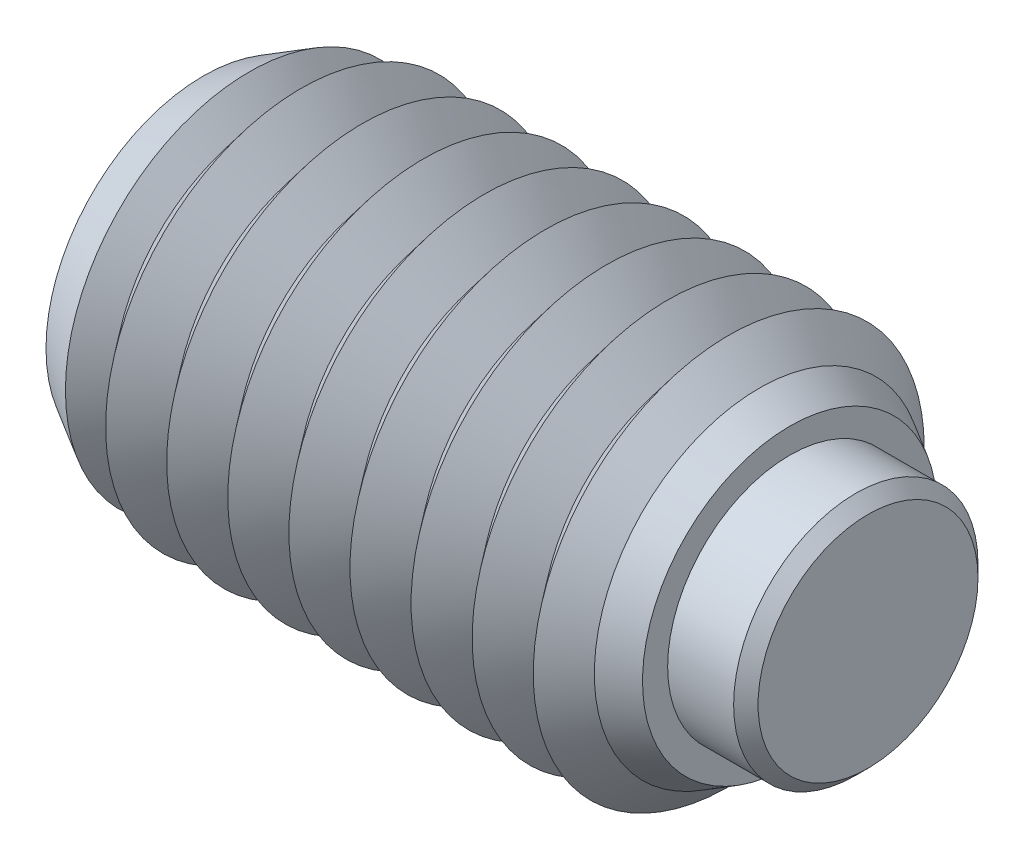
ISO-10303-21;
HEADER;
FILE_DESCRIPTION(('STEP AP214'),'2;1');
FILE_NAME('part.step','',(''),(''),'','','');
FILE_SCHEMA(('AUTOMOTIVE_DESIGN { 1 0 10303 214 1 1 1 1 }'));
ENDSEC;
DATA;
#1=APPLICATION_CONTEXT('core data for automotive mechanical design processes');
#2=APPLICATION_PROTOCOL_DEFINITION('international standard','automotive_design',2000,#1);
#3=PRODUCT_CONTEXT('',#1,'mechanical');
#4=PRODUCT('Part','Part','',(#3));
#5=PRODUCT_RELATED_PRODUCT_CATEGORY('part','',(#4));
#6=PRODUCT_DEFINITION_FORMATION('','',#4);
#7=PRODUCT_DEFINITION_CONTEXT('part definition',#1,'design');
#8=PRODUCT_DEFINITION('design','',#6,#7);
#9=PRODUCT_DEFINITION_SHAPE('','',#8);
#10=(LENGTH_UNIT() NAMED_UNIT(*) SI_UNIT(.MILLI.,.METRE.));
#11=(NAMED_UNIT(*) PLANE_ANGLE_UNIT() SI_UNIT($,.RADIAN.));
#12=(NAMED_UNIT(*) SI_UNIT($,.STERADIAN.) SOLID_ANGLE_UNIT());
#13=UNCERTAINTY_MEASURE_WITH_UNIT(LENGTH_MEASURE(1.E-05),#10,'distance_accuracy_value','');
#14=(GEOMETRIC_REPRESENTATION_CONTEXT(3) GLOBAL_UNCERTAINTY_ASSIGNED_CONTEXT((#13)) GLOBAL_UNIT_ASSIGNED_CONTEXT((#10,
#11,#12)) REPRESENTATION_CONTEXT('',''));
#15=CARTESIAN_POINT('',(0.,0.,0.));
#16=DIRECTION('',(0.,0.,1.));
#17=DIRECTION('',(1.,0.,0.));
#18=AXIS2_PLACEMENT_3D('',#15,#16,#17);
#19=CARTESIAN_POINT('',(2.225,0.,0.));
#20=DIRECTION('',(-1.,0.,0.));
#21=DIRECTION('',(0.,0.,1.));
#22=AXIS2_PLACEMENT_3D('',#19,#20,#21);
#23=CYLINDRICAL_SURFACE('',#22,2.5);
#24=CARTESIAN_POINT('',(1.975,0.,0.));
#25=DIRECTION('',(1.,0.,0.));
#26=DIRECTION('',(0.,0.,-1.));
#27=AXIS2_PLACEMENT_3D('',#24,#25,#26);
#28=CIRCLE('',#27,2.5);
#29=CARTESIAN_POINT('',(1.975,0.,-2.5));
#30=VERTEX_POINT('',#29);
#31=EDGE_CURVE('P0_E10',#30,#30,#28,.F.);
#32=ORIENTED_EDGE('',*,*,#31,.T.);
#33=EDGE_LOOP('',(#32));
#34=FACE_BOUND('',#33,.T.);
#35=CARTESIAN_POINT('',(-0.975,0.,0.));
#36=DIRECTION('',(1.,0.,0.));
#37=DIRECTION('',(0.,0.,-1.));
#38=AXIS2_PLACEMENT_3D('',#35,#36,#37);
#39=CIRCLE('',#38,2.5);
#40=CARTESIAN_POINT('',(-0.975,0.,-2.5));
#41=VERTEX_POINT('',#40);
#42=EDGE_CURVE('P0_E25',#41,#41,#39,.T.);
#43=ORIENTED_EDGE('',*,*,#42,.T.);
#44=EDGE_LOOP('',(#43));
#45=FACE_BOUND('',#44,.T.);
#46=ADVANCED_FACE('P0_F14',(#34,#45),#23,.T.);
#47=CARTESIAN_POINT('',(2.225,0.,0.));
#48=DIRECTION('',(1.,0.,0.));
#49=DIRECTION('',(0.,0.,-1.));
#50=AXIS2_PLACEMENT_3D('',#47,#48,#49);
#51=PLANE('',#50);
#52=CARTESIAN_POINT('',(2.225,0.,0.));
#53=DIRECTION('',(1.,0.,0.));
#54=DIRECTION('',(0.,0.,-1.));
#55=AXIS2_PLACEMENT_3D('',#52,#53,#54);
#56=CIRCLE('',#55,2.25);
#57=CARTESIAN_POINT('',(2.225,0.,-2.25));
#58=VERTEX_POINT('',#57);
#59=EDGE_CURVE('P0_E21',#58,#58,#56,.T.);
#60=ORIENTED_EDGE('',*,*,#59,.T.);
#61=EDGE_LOOP('',(#60));
#62=FACE_BOUND('',#61,.T.);
#63=ADVANCED_FACE('P0_F35',(#62),#51,.T.);
#64=CARTESIAN_POINT('',(-0.975,0.,0.));
#65=DIRECTION('',(1.,0.,0.));
#66=DIRECTION('',(0.,0.,-1.));
#67=AXIS2_PLACEMENT_3D('',#64,#65,#66);
#68=PLANE('',#67);
#69=ORIENTED_EDGE('',*,*,#42,.F.);
#70=EDGE_LOOP('',(#69));
#71=FACE_BOUND('',#70,.T.);
#72=ADVANCED_FACE('P0_F33',(#71),#68,.F.);
#73=CARTESIAN_POINT('',(2.225,0.,0.));
#74=DIRECTION('',(-1.,0.,0.));
#75=DIRECTION('',(0.,0.,1.));
#76=AXIS2_PLACEMENT_3D('',#73,#74,#75);
#77=CONICAL_SURFACE('',#76,2.25,0.785398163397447);
#78=ORIENTED_EDGE('',*,*,#31,.F.);
#79=EDGE_LOOP('',(#78));
#80=FACE_BOUND('',#79,.T.);
#81=ORIENTED_EDGE('',*,*,#59,.F.);
#82=EDGE_LOOP('',(#81));
#83=FACE_BOUND('',#82,.T.);
#84=ADVANCED_FACE('P0_F16',(#80,#83),#77,.T.);
#85=CLOSED_SHELL('',(#46,#63,#72,#84));
#86=MANIFOLD_SOLID_BREP('P0_B1',#85);
#87=CARTESIAN_POINT('',(-10.625,0.,0.));
#88=DIRECTION('',(-1.,0.,0.));
#89=DIRECTION('',(0.,0.,1.));
#90=AXIS2_PLACEMENT_3D('',#87,#88,#89);
#91=CONICAL_SURFACE('',#90,4.,0.895664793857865);
#92=CARTESIAN_POINT('',(-10.,0.,0.));
#93=DIRECTION('',(1.,0.,0.));
#94=DIRECTION('',(0.,0.,-1.));
#95=AXIS2_PLACEMENT_3D('',#92,#93,#94);
#96=CIRCLE('',#95,3.2193752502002);
#97=CARTESIAN_POINT('',(-10.,0.,-3.2193752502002));
#98=VERTEX_POINT('',#97);
#99=EDGE_CURVE('P1_E697',#98,#98,#96,.T.);
#100=ORIENTED_EDGE('',*,*,#99,.F.);
#101=EDGE_LOOP('',(#100));
#102=FACE_BOUND('',#101,.T.);
#103=CARTESIAN_POINT('',(-10.4346684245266,0.,0.));
#104=DIRECTION('',(1.,0.,0.));
#105=DIRECTION('',(0.,0.,-1.));
#106=AXIS2_PLACEMENT_3D('',#103,#104,#105);
#107=CIRCLE('',#106,3.76227593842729);
#108=CARTESIAN_POINT('',(-10.4346684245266,0.,-3.76227593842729));
#109=VERTEX_POINT('',#108);
#110=EDGE_CURVE('P1_E700',#109,#109,#107,.F.);
#111=ORIENTED_EDGE('',*,*,#110,.F.);
#112=EDGE_LOOP('',(#111));
#113=FACE_BOUND('',#112,.T.);
#114=ADVANCED_FACE('P1_F15',(#102,#113),#91,.T.);
#115=CARTESIAN_POINT('',(-1.25,0.,0.));
#116=DIRECTION('',(1.,0.,0.));
#117=DIRECTION('',(0.,0.,-1.));
#118=AXIS2_PLACEMENT_3D('',#115,#116,#117);
#119=CONICAL_SURFACE('',#118,3.2193752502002,0.895664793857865);
#120=CARTESIAN_POINT('',(-0.625000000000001,0.,0.));
#121=DIRECTION('',(1.,0.,0.));
#122=DIRECTION('',(0.,0.,-1.));
#123=AXIS2_PLACEMENT_3D('',#120,#121,#122);
#124=CIRCLE('',#123,4.);
#125=CARTESIAN_POINT('',(-0.625000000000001,0.,-4.));
#126=VERTEX_POINT('',#125);
#127=EDGE_CURVE('P1_E651',#126,#126,#124,.T.);
#128=ORIENTED_EDGE('',*,*,#127,.F.);
#129=EDGE_LOOP('',(#128));
#130=FACE_BOUND('',#129,.T.);
#131=CARTESIAN_POINT('',(-1.25,0.,0.));
#132=DIRECTION('',(1.,0.,0.));
#133=DIRECTION('',(0.,0.,-1.));
#134=AXIS2_PLACEMENT_3D('',#131,#132,#133);
#135=CIRCLE('',#134,3.2193752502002);
#136=CARTESIAN_POINT('',(-1.25,0.,-3.2193752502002));
#137=VERTEX_POINT('',#136);
#138=EDGE_CURVE('P1_E652',#137,#137,#135,.T.);
#139=ORIENTED_EDGE('',*,*,#138,.T.);
#140=EDGE_LOOP('',(#139));
#141=FACE_BOUND('',#140,.T.);
#142=ADVANCED_FACE('P1_F222',(#130,#141),#119,.T.);
#143=CARTESIAN_POINT('',(-1.875,0.,0.));
#144=DIRECTION('',(-1.,0.,0.));
#145=DIRECTION('',(0.,0.,1.));
#146=AXIS2_PLACEMENT_3D('',#143,#144,#145);
#147=CONICAL_SURFACE('',#146,4.,0.895664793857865);
#148=ORIENTED_EDGE('',*,*,#138,.F.);
#149=EDGE_LOOP('',(#148));
#150=FACE_BOUND('',#149,.T.);
#151=CARTESIAN_POINT('',(-1.875,0.,0.));
#152=DIRECTION('',(1.,0.,0.));
#153=DIRECTION('',(0.,0.,-1.));
#154=AXIS2_PLACEMENT_3D('',#151,#152,#153);
#155=CIRCLE('',#154,4.);
#156=CARTESIAN_POINT('',(-1.875,0.,-4.));
#157=VERTEX_POINT('',#156);
#158=EDGE_CURVE('P1_E656',#157,#157,#155,.T.);
#159=ORIENTED_EDGE('',*,*,#158,.T.);
#160=EDGE_LOOP('',(#159));
#161=FACE_BOUND('',#160,.T.);
#162=ADVANCED_FACE('P1_F227',(#150,#161),#147,.T.);
#163=CARTESIAN_POINT('',(-0.975,0.,0.));
#164=DIRECTION('',(1.,0.,0.));
#165=DIRECTION('',(0.,1.,0.));
#166=AXIS2_PLACEMENT_3D('',#163,#164,#165);
#167=PLANE('',#166);
#168=CARTESIAN_POINT('',(-0.975,0.,0.));
#169=DIRECTION('',(1.,0.,0.));
#170=DIRECTION('',(0.,1.,0.));
#171=AXIS2_PLACEMENT_3D('',#168,#169,#170);
#172=CIRCLE('',#171,2.5);
#173=CARTESIAN_POINT('',(-0.975,2.5,0.));
#174=VERTEX_POINT('',#173);
#175=EDGE_CURVE('P1_E358',#174,#174,#172,.T.);
#176=ORIENTED_EDGE('',*,*,#175,.T.);
#177=EDGE_LOOP('',(#176));
#178=FACE_BOUND('',#177,.T.);
#179=ADVANCED_FACE('P1_F285',(#178),#167,.T.);
#180=CARTESIAN_POINT('',(-0.975,0.,0.));
#181=DIRECTION('',(1.,0.,0.));
#182=DIRECTION('',(0.,1.,0.));
#183=AXIS2_PLACEMENT_3D('',#180,#181,#182);
#184=CYLINDRICAL_SURFACE('',#183,2.5);
#185=ORIENTED_EDGE('',*,*,#175,.F.);
#186=EDGE_LOOP('',(#185));
#187=FACE_BOUND('',#186,.T.);
#188=CARTESIAN_POINT('',(0.625,0.,0.));
#189=DIRECTION('',(1.,0.,0.));
#190=DIRECTION('',(0.,1.,0.));
#191=AXIS2_PLACEMENT_3D('',#188,#189,#190);
#192=CIRCLE('',#191,2.5);
#193=CARTESIAN_POINT('',(0.625,2.5,0.));
#194=VERTEX_POINT('',#193);
#195=EDGE_CURVE('P1_E361',#194,#194,#192,.T.);
#196=ORIENTED_EDGE('',*,*,#195,.T.);
#197=EDGE_LOOP('',(#196));
#198=FACE_BOUND('',#197,.T.);
#199=ADVANCED_FACE('P1_F209',(#187,#198),#184,.F.);
#200=CARTESIAN_POINT('',(0.625,3.01415608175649,0.));
#201=DIRECTION('',(1.,0.,0.));
#202=DIRECTION('',(0.,1.,0.));
#203=AXIS2_PLACEMENT_3D('',#200,#201,#202);
#204=PLANE('',#203);
#205=ORIENTED_EDGE('',*,*,#195,.F.);
#206=EDGE_LOOP('',(#205));
#207=FACE_BOUND('',#206,.T.);
#208=CARTESIAN_POINT('',(0.625,0.,0.));
#209=DIRECTION('',(1.,0.,0.));
#210=DIRECTION('',(0.,1.,0.));
#211=AXIS2_PLACEMENT_3D('',#208,#209,#210);
#212=CIRCLE('',#211,3.01415608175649);
#213=CARTESIAN_POINT('',(0.625,3.01415608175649,0.));
#214=VERTEX_POINT('',#213);
#215=EDGE_CURVE('P1_E121',#214,#214,#212,.T.);
#216=ORIENTED_EDGE('',*,*,#215,.T.);
#217=EDGE_LOOP('',(#216));
#218=FACE_BOUND('',#217,.T.);
#219=ADVANCED_FACE('P1_F206',(#207,#218),#204,.T.);
#220=CARTESIAN_POINT('',(0.625,0.,0.));
#221=DIRECTION('',(-1.,0.,0.));
#222=DIRECTION('',(0.,-1.,0.));
#223=AXIS2_PLACEMENT_3D('',#220,#221,#222);
#224=CONICAL_SURFACE('',#223,3.01415608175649,0.523598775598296);
#225=CARTESIAN_POINT('',(0.,0.,0.));
#226=DIRECTION('',(1.,0.,0.));
#227=DIRECTION('',(0.,0.,-1.));
#228=AXIS2_PLACEMENT_3D('',#225,#226,#227);
#229=CIRCLE('',#228,3.375);
#230=CARTESIAN_POINT('',(0.,0.,-3.375));
#231=VERTEX_POINT('',#230);
#232=EDGE_CURVE('P1_E349',#231,#231,#229,.T.);
#233=ORIENTED_EDGE('',*,*,#232,.T.);
#234=EDGE_LOOP('',(#233));
#235=FACE_BOUND('',#234,.T.);
#236=ORIENTED_EDGE('',*,*,#215,.F.);
#237=EDGE_LOOP('',(#236));
#238=FACE_BOUND('',#237,.T.);
#239=ADVANCED_FACE('P1_F203',(#235,#238),#224,.T.);
#240=CARTESIAN_POINT('',(0.,0.,0.));
#241=DIRECTION('',(-1.,0.,0.));
#242=DIRECTION('',(0.,0.,1.));
#243=AXIS2_PLACEMENT_3D('',#240,#241,#242);
#244=CONICAL_SURFACE('',#243,3.375,0.785398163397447);
#245=ORIENTED_EDGE('',*,*,#127,.T.);
#246=EDGE_LOOP('',(#245));
#247=FACE_BOUND('',#246,.T.);
#248=ORIENTED_EDGE('',*,*,#232,.F.);
#249=EDGE_LOOP('',(#248));
#250=FACE_BOUND('',#249,.T.);
#251=ADVANCED_FACE('P1_F17',(#247,#250),#244,.T.);
#252=CARTESIAN_POINT('',(-2.5,0.,0.));
#253=DIRECTION('',(1.,0.,0.));
#254=DIRECTION('',(0.,0.,-1.));
#255=AXIS2_PLACEMENT_3D('',#252,#253,#254);
#256=CONICAL_SURFACE('',#255,3.2193752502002,0.895664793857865);
#257=ORIENTED_EDGE('',*,*,#158,.F.);
#258=EDGE_LOOP('',(#257));
#259=FACE_BOUND('',#258,.T.);
#260=CARTESIAN_POINT('',(-2.5,0.,0.));
#261=DIRECTION('',(1.,0.,0.));
#262=DIRECTION('',(0.,0.,-1.));
#263=AXIS2_PLACEMENT_3D('',#260,#261,#262);
#264=CIRCLE('',#263,3.2193752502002);
#265=CARTESIAN_POINT('',(-2.5,0.,-3.2193752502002));
#266=VERTEX_POINT('',#265);
#267=EDGE_CURVE('P1_E661',#266,#266,#264,.T.);
#268=ORIENTED_EDGE('',*,*,#267,.T.);
#269=EDGE_LOOP('',(#268));
#270=FACE_BOUND('',#269,.T.);
#271=ADVANCED_FACE('P1_F279',(#259,#270),#256,.T.);
#272=CARTESIAN_POINT('',(-3.125,0.,0.));
#273=DIRECTION('',(-1.,0.,0.));
#274=DIRECTION('',(0.,0.,1.));
#275=AXIS2_PLACEMENT_3D('',#272,#273,#274);
#276=CONICAL_SURFACE('',#275,4.,0.895664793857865);
#277=ORIENTED_EDGE('',*,*,#267,.F.);
#278=EDGE_LOOP('',(#277));
#279=FACE_BOUND('',#278,.T.);
#280=CARTESIAN_POINT('',(-3.125,0.,0.));
#281=DIRECTION('',(1.,0.,0.));
#282=DIRECTION('',(0.,0.,-1.));
#283=AXIS2_PLACEMENT_3D('',#280,#281,#282);
#284=CIRCLE('',#283,4.);
#285=CARTESIAN_POINT('',(-3.125,0.,-4.));
#286=VERTEX_POINT('',#285);
#287=EDGE_CURVE('P1_E664',#286,#286,#284,.T.);
#288=ORIENTED_EDGE('',*,*,#287,.T.);
#289=EDGE_LOOP('',(#288));
#290=FACE_BOUND('',#289,.T.);
#291=ADVANCED_FACE('P1_F275',(#279,#290),#276,.T.);
#292=CARTESIAN_POINT('',(-3.75,0.,0.));
#293=DIRECTION('',(1.,0.,0.));
#294=DIRECTION('',(0.,0.,-1.));
#295=AXIS2_PLACEMENT_3D('',#292,#293,#294);
#296=CONICAL_SURFACE('',#295,3.2193752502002,0.895664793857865);
#297=ORIENTED_EDGE('',*,*,#287,.F.);
#298=EDGE_LOOP('',(#297));
#299=FACE_BOUND('',#298,.T.);
#300=CARTESIAN_POINT('',(-3.75,0.,0.));
#301=DIRECTION('',(1.,0.,0.));
#302=DIRECTION('',(0.,0.,-1.));
#303=AXIS2_PLACEMENT_3D('',#300,#301,#302);
#304=CIRCLE('',#303,3.2193752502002);
#305=CARTESIAN_POINT('',(-3.75,0.,-3.2193752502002));
#306=VERTEX_POINT('',#305);
#307=EDGE_CURVE('P1_E667',#306,#306,#304,.T.);
#308=ORIENTED_EDGE('',*,*,#307,.T.);
#309=EDGE_LOOP('',(#308));
#310=FACE_BOUND('',#309,.T.);
#311=ADVANCED_FACE('P1_F271',(#299,#310),#296,.T.);
#312=CARTESIAN_POINT('',(-4.375,0.,0.));
#313=DIRECTION('',(-1.,0.,0.));
#314=DIRECTION('',(0.,0.,1.));
#315=AXIS2_PLACEMENT_3D('',#312,#313,#314);
#316=CONICAL_SURFACE('',#315,4.,0.895664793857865);
#317=ORIENTED_EDGE('',*,*,#307,.F.);
#318=EDGE_LOOP('',(#317));
#319=FACE_BOUND('',#318,.T.);
#320=CARTESIAN_POINT('',(-4.375,0.,0.));
#321=DIRECTION('',(1.,0.,0.));
#322=DIRECTION('',(0.,0.,-1.));
#323=AXIS2_PLACEMENT_3D('',#320,#321,#322);
#324=CIRCLE('',#323,4.);
#325=CARTESIAN_POINT('',(-4.375,0.,-4.));
#326=VERTEX_POINT('',#325);
#327=EDGE_CURVE('P1_E670',#326,#326,#324,.T.);
#328=ORIENTED_EDGE('',*,*,#327,.T.);
#329=EDGE_LOOP('',(#328));
#330=FACE_BOUND('',#329,.T.);
#331=ADVANCED_FACE('P1_F267',(#319,#330),#316,.T.);
#332=CARTESIAN_POINT('',(-5.,0.,0.));
#333=DIRECTION('',(1.,0.,0.));
#334=DIRECTION('',(0.,0.,-1.));
#335=AXIS2_PLACEMENT_3D('',#332,#333,#334);
#336=CONICAL_SURFACE('',#335,3.2193752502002,0.895664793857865);
#337=ORIENTED_EDGE('',*,*,#327,.F.);
#338=EDGE_LOOP('',(#337));
#339=FACE_BOUND('',#338,.T.);
#340=CARTESIAN_POINT('',(-5.,0.,0.));
#341=DIRECTION('',(1.,0.,0.));
#342=DIRECTION('',(0.,0.,-1.));
#343=AXIS2_PLACEMENT_3D('',#340,#341,#342);
#344=CIRCLE('',#343,3.2193752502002);
#345=CARTESIAN_POINT('',(-5.,0.,-3.2193752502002));
#346=VERTEX_POINT('',#345);
#347=EDGE_CURVE('P1_E673',#346,#346,#344,.T.);
#348=ORIENTED_EDGE('',*,*,#347,.T.);
#349=EDGE_LOOP('',(#348));
#350=FACE_BOUND('',#349,.T.);
#351=ADVANCED_FACE('P1_F263',(#339,#350),#336,.T.);
#352=CARTESIAN_POINT('',(-5.625,0.,0.));
#353=DIRECTION('',(-1.,0.,0.));
#354=DIRECTION('',(0.,0.,1.));
#355=AXIS2_PLACEMENT_3D('',#352,#353,#354);
#356=CONICAL_SURFACE('',#355,4.,0.895664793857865);
#357=ORIENTED_EDGE('',*,*,#347,.F.);
#358=EDGE_LOOP('',(#357));
#359=FACE_BOUND('',#358,.T.);
#360=CARTESIAN_POINT('',(-5.625,0.,0.));
#361=DIRECTION('',(1.,0.,0.));
#362=DIRECTION('',(0.,0.,-1.));
#363=AXIS2_PLACEMENT_3D('',#360,#361,#362);
#364=CIRCLE('',#363,4.);
#365=CARTESIAN_POINT('',(-5.625,0.,-4.));
#366=VERTEX_POINT('',#365);
#367=EDGE_CURVE('P1_E676',#366,#366,#364,.T.);
#368=ORIENTED_EDGE('',*,*,#367,.T.);
#369=EDGE_LOOP('',(#368));
#370=FACE_BOUND('',#369,.T.);
#371=ADVANCED_FACE('P1_F259',(#359,#370),#356,.T.);
#372=CARTESIAN_POINT('',(-6.25,0.,0.));
#373=DIRECTION('',(1.,0.,0.));
#374=DIRECTION('',(0.,0.,-1.));
#375=AXIS2_PLACEMENT_3D('',#372,#373,#374);
#376=CONICAL_SURFACE('',#375,3.2193752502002,0.895664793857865);
#377=ORIENTED_EDGE('',*,*,#367,.F.);
#378=EDGE_LOOP('',(#377));
#379=FACE_BOUND('',#378,.T.);
#380=CARTESIAN_POINT('',(-6.25,0.,0.));
#381=DIRECTION('',(1.,0.,0.));
#382=DIRECTION('',(0.,0.,-1.));
#383=AXIS2_PLACEMENT_3D('',#380,#381,#382);
#384=CIRCLE('',#383,3.2193752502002);
#385=CARTESIAN_POINT('',(-6.25,0.,-3.2193752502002));
#386=VERTEX_POINT('',#385);
#387=EDGE_CURVE('P1_E679',#386,#386,#384,.T.);
#388=ORIENTED_EDGE('',*,*,#387,.T.);
#389=EDGE_LOOP('',(#388));
#390=FACE_BOUND('',#389,.T.);
#391=ADVANCED_FACE('P1_F255',(#379,#390),#376,.T.);
#392=CARTESIAN_POINT('',(-6.875,0.,0.));
#393=DIRECTION('',(-1.,0.,0.));
#394=DIRECTION('',(0.,0.,1.));
#395=AXIS2_PLACEMENT_3D('',#392,#393,#394);
#396=CONICAL_SURFACE('',#395,4.,0.895664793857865);
#397=ORIENTED_EDGE('',*,*,#387,.F.);
#398=EDGE_LOOP('',(#397));
#399=FACE_BOUND('',#398,.T.);
#400=CARTESIAN_POINT('',(-6.875,0.,0.));
#401=DIRECTION('',(1.,0.,0.));
#402=DIRECTION('',(0.,0.,-1.));
#403=AXIS2_PLACEMENT_3D('',#400,#401,#402);
#404=CIRCLE('',#403,4.);
#405=CARTESIAN_POINT('',(-6.875,0.,-4.));
#406=VERTEX_POINT('',#405);
#407=EDGE_CURVE('P1_E682',#406,#406,#404,.T.);
#408=ORIENTED_EDGE('',*,*,#407,.T.);
#409=EDGE_LOOP('',(#408));
#410=FACE_BOUND('',#409,.T.);
#411=ADVANCED_FACE('P1_F251',(#399,#410),#396,.T.);
#412=CARTESIAN_POINT('',(-7.5,0.,0.));
#413=DIRECTION('',(1.,0.,0.));
#414=DIRECTION('',(0.,0.,-1.));
#415=AXIS2_PLACEMENT_3D('',#412,#413,#414);
#416=CONICAL_SURFACE('',#415,3.2193752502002,0.895664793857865);
#417=ORIENTED_EDGE('',*,*,#407,.F.);
#418=EDGE_LOOP('',(#417));
#419=FACE_BOUND('',#418,.T.);
#420=CARTESIAN_POINT('',(-7.5,0.,0.));
#421=DIRECTION('',(1.,0.,0.));
#422=DIRECTION('',(0.,0.,-1.));
#423=AXIS2_PLACEMENT_3D('',#420,#421,#422);
#424=CIRCLE('',#423,3.2193752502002);
#425=CARTESIAN_POINT('',(-7.5,0.,-3.2193752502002));
#426=VERTEX_POINT('',#425);
#427=EDGE_CURVE('P1_E685',#426,#426,#424,.T.);
#428=ORIENTED_EDGE('',*,*,#427,.T.);
#429=EDGE_LOOP('',(#428));
#430=FACE_BOUND('',#429,.T.);
#431=ADVANCED_FACE('P1_F247',(#419,#430),#416,.T.);
#432=CARTESIAN_POINT('',(-8.125,0.,0.));
#433=DIRECTION('',(-1.,0.,0.));
#434=DIRECTION('',(0.,0.,1.));
#435=AXIS2_PLACEMENT_3D('',#432,#433,#434);
#436=CONICAL_SURFACE('',#435,4.,0.895664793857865);
#437=ORIENTED_EDGE('',*,*,#427,.F.);
#438=EDGE_LOOP('',(#437));
#439=FACE_BOUND('',#438,.T.);
#440=CARTESIAN_POINT('',(-8.125,0.,0.));
#441=DIRECTION('',(1.,0.,0.));
#442=DIRECTION('',(0.,0.,-1.));
#443=AXIS2_PLACEMENT_3D('',#440,#441,#442);
#444=CIRCLE('',#443,4.);
#445=CARTESIAN_POINT('',(-8.125,0.,-4.));
#446=VERTEX_POINT('',#445);
#447=EDGE_CURVE('P1_E688',#446,#446,#444,.T.);
#448=ORIENTED_EDGE('',*,*,#447,.T.);
#449=EDGE_LOOP('',(#448));
#450=FACE_BOUND('',#449,.T.);
#451=ADVANCED_FACE('P1_F243',(#439,#450),#436,.T.);
#452=CARTESIAN_POINT('',(-8.75,0.,0.));
#453=DIRECTION('',(1.,0.,0.));
#454=DIRECTION('',(0.,0.,-1.));
#455=AXIS2_PLACEMENT_3D('',#452,#453,#454);
#456=CONICAL_SURFACE('',#455,3.2193752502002,0.895664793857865);
#457=ORIENTED_EDGE('',*,*,#447,.F.);
#458=EDGE_LOOP('',(#457));
#459=FACE_BOUND('',#458,.T.);
#460=CARTESIAN_POINT('',(-8.75,0.,0.));
#461=DIRECTION('',(1.,0.,0.));
#462=DIRECTION('',(0.,0.,-1.));
#463=AXIS2_PLACEMENT_3D('',#460,#461,#462);
#464=CIRCLE('',#463,3.2193752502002);
#465=CARTESIAN_POINT('',(-8.75,0.,-3.2193752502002));
#466=VERTEX_POINT('',#465);
#467=EDGE_CURVE('P1_E691',#466,#466,#464,.T.);
#468=ORIENTED_EDGE('',*,*,#467,.T.);
#469=EDGE_LOOP('',(#468));
#470=FACE_BOUND('',#469,.T.);
#471=ADVANCED_FACE('P1_F239',(#459,#470),#456,.T.);
#472=CARTESIAN_POINT('',(-9.375,0.,0.));
#473=DIRECTION('',(-1.,0.,0.));
#474=DIRECTION('',(0.,0.,1.));
#475=AXIS2_PLACEMENT_3D('',#472,#473,#474);
#476=CONICAL_SURFACE('',#475,4.,0.895664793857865);
#477=ORIENTED_EDGE('',*,*,#467,.F.);
#478=EDGE_LOOP('',(#477));
#479=FACE_BOUND('',#478,.T.);
#480=CARTESIAN_POINT('',(-9.375,0.,0.));
#481=DIRECTION('',(1.,0.,0.));
#482=DIRECTION('',(0.,0.,-1.));
#483=AXIS2_PLACEMENT_3D('',#480,#481,#482);
#484=CIRCLE('',#483,4.);
#485=CARTESIAN_POINT('',(-9.375,0.,-4.));
#486=VERTEX_POINT('',#485);
#487=EDGE_CURVE('P1_E694',#486,#486,#484,.T.);
#488=ORIENTED_EDGE('',*,*,#487,.T.);
#489=EDGE_LOOP('',(#488));
#490=FACE_BOUND('',#489,.T.);
#491=ADVANCED_FACE('P1_F235',(#479,#490),#476,.T.);
#492=CARTESIAN_POINT('',(-10.,0.,0.));
#493=DIRECTION('',(1.,0.,0.));
#494=DIRECTION('',(0.,0.,-1.));
#495=AXIS2_PLACEMENT_3D('',#492,#493,#494);
#496=CONICAL_SURFACE('',#495,3.2193752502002,0.895664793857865);
#497=ORIENTED_EDGE('',*,*,#487,.F.);
#498=EDGE_LOOP('',(#497));
#499=FACE_BOUND('',#498,.T.);
#500=ORIENTED_EDGE('',*,*,#99,.T.);
#501=EDGE_LOOP('',(#500));
#502=FACE_BOUND('',#501,.T.);
#503=ADVANCED_FACE('P1_F219',(#499,#502),#496,.T.);
#504=CARTESIAN_POINT('',(-11.375,0.,0.));
#505=DIRECTION('',(1.,0.,0.));
#506=DIRECTION('',(0.,0.,1.));
#507=AXIS2_PLACEMENT_3D('',#504,#505,#506);
#508=CONICAL_SURFACE('',#507,3.2193752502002,0.5235987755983);
#509=CARTESIAN_POINT('',(-11.375,0.,0.));
#510=DIRECTION('',(-1.,0.,0.));
#511=DIRECTION('',(0.,0.,1.));
#512=AXIS2_PLACEMENT_3D('',#509,#510,#511);
#513=CIRCLE('',#512,3.2193752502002);
#514=CARTESIAN_POINT('',(-11.375,0.,3.2193752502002));
#515=VERTEX_POINT('',#514);
#516=EDGE_CURVE('P1_E702',#515,#515,#513,.T.);
#517=ORIENTED_EDGE('',*,*,#516,.F.);
#518=EDGE_LOOP('',(#517));
#519=FACE_BOUND('',#518,.T.);
#520=ORIENTED_EDGE('',*,*,#110,.T.);
#521=EDGE_LOOP('',(#520));
#522=FACE_BOUND('',#521,.T.);
#523=ADVANCED_FACE('P1_F159',(#519,#522),#508,.T.);
#524=CARTESIAN_POINT('',(-11.375,0.,0.));
#525=DIRECTION('',(1.,0.,0.));
#526=DIRECTION('',(0.,0.,-1.));
#527=AXIS2_PLACEMENT_3D('',#524,#525,#526);
#528=PLANE('',#527);
#529=CARTESIAN_POINT('',(-11.375,0.,0.));
#530=DIRECTION('',(1.,0.,0.));
#531=DIRECTION('',(0.,0.,-1.));
#532=AXIS2_PLACEMENT_3D('',#529,#530,#531);
#533=CIRCLE('',#532,2.3094010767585);
#534=CARTESIAN_POINT('',(-11.375,-2.,-1.15470053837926));
#535=VERTEX_POINT('',#534);
#536=CARTESIAN_POINT('',(-11.375,0.,-2.3094010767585));
#537=VERTEX_POINT('',#536);
#538=EDGE_CURVE('P1_E19',#535,#537,#533,.T.);
#539=ORIENTED_EDGE('',*,*,#538,.T.);
#540=CARTESIAN_POINT('',(-11.375,2.,-1.15470053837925));
#541=VERTEX_POINT('',#540);
#542=EDGE_CURVE('P1_E10',#537,#541,#533,.T.);
#543=ORIENTED_EDGE('',*,*,#542,.T.);
#544=CARTESIAN_POINT('',(-11.375,2.,1.15470053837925));
#545=VERTEX_POINT('',#544);
#546=EDGE_CURVE('P1_E24',#541,#545,#533,.T.);
#547=ORIENTED_EDGE('',*,*,#546,.T.);
#548=CARTESIAN_POINT('',(-11.375,0.,0.));
#549=DIRECTION('',(-1.,0.,0.));
#550=DIRECTION('',(0.,0.,1.));
#551=AXIS2_PLACEMENT_3D('',#548,#549,#550);
#552=CIRCLE('',#551,2.3094010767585);
#553=CARTESIAN_POINT('',(-11.375,0.,2.3094010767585));
#554=VERTEX_POINT('',#553);
#555=EDGE_CURVE('P1_E92',#554,#545,#552,.T.);
#556=ORIENTED_EDGE('',*,*,#555,.F.);
#557=CARTESIAN_POINT('',(-11.375,-2.,1.15470053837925));
#558=VERTEX_POINT('',#557);
#559=EDGE_CURVE('P1_E101',#554,#558,#533,.T.);
#560=ORIENTED_EDGE('',*,*,#559,.T.);
#561=EDGE_CURVE('P1_E107',#558,#535,#533,.T.);
#562=ORIENTED_EDGE('',*,*,#561,.T.);
#563=EDGE_LOOP('',(#539,#543,#547,#556,#560,#562));
#564=FACE_BOUND('',#563,.T.);
#565=ORIENTED_EDGE('',*,*,#516,.T.);
#566=EDGE_LOOP('',(#565));
#567=FACE_BOUND('',#566,.T.);
#568=ADVANCED_FACE('P1_F108',(#564,#567),#528,.F.);
#569=CARTESIAN_POINT('',(-11.375,0.,0.));
#570=DIRECTION('',(-1.,0.,0.));
#571=DIRECTION('',(0.,0.,1.));
#572=AXIS2_PLACEMENT_3D('',#569,#570,#571);
#573=CONICAL_SURFACE('',#572,2.3094010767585,1.0471975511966);
#574=ORIENTED_EDGE('',*,*,#538,.F.);
#575=CARTESIAN_POINT('',(-11.3750666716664,0.000199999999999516,-2.30951654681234));
#576=CARTESIAN_POINT('',(-11.3457567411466,-0.0876912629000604,-2.25877250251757));
#577=CARTESIAN_POINT('',(-11.3191000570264,-0.176341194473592,-2.20759044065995));
#578=CARTESIAN_POINT('',(-11.2725696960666,-0.355176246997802,-2.10433997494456));
#579=CARTESIAN_POINT('',(-11.2527124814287,-0.445364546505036,-2.0522697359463));
#580=CARTESIAN_POINT('',(-11.2218006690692,-0.624623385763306,-1.94877459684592));
#581=CARTESIAN_POINT('',(-11.2105403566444,-0.713666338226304,-1.89736562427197));
#582=CARTESIAN_POINT('',(-11.1970958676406,-0.892171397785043,-1.79430568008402));
#583=CARTESIAN_POINT('',(-11.1949005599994,-0.981632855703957,-1.74265508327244));
#584=CARTESIAN_POINT('',(-11.1994581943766,-1.1488083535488,-1.64613626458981));
#585=CARTESIAN_POINT('',(-11.2050920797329,-1.22654737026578,-1.60125362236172));
#586=CARTESIAN_POINT('',(-11.2229511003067,-1.38151891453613,-1.51178075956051));
#587=CARTESIAN_POINT('',(-11.2351823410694,-1.4587509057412,-1.46719084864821));
#588=CARTESIAN_POINT('',(-11.2657606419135,-1.6140421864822,-1.37753338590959));
#589=CARTESIAN_POINT('',(-11.2842373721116,-1.69208181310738,-1.33247718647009));
#590=CARTESIAN_POINT('',(-11.3261727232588,-1.84699686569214,-1.24303693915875));
#591=CARTESIAN_POINT('',(-11.3496214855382,-1.92387427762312,-1.1986517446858));
#592=CARTESIAN_POINT('',(-11.3750666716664,-2.0002,-1.15458506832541));
#593=B_SPLINE_CURVE_WITH_KNOTS('',3,(#575,#576,#577,#578,#579,#580,#581,#582,#583,#584,#585,
#586,#587,#588,#589,#590,#591,#592),.UNSPECIFIED.,.F.,.F.,(4,2,2,2,2,2,2,2,4),(0.,
0.317031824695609,0.634825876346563,0.944753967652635,1.25430138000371,1.52387047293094,
1.79368946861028,2.06949491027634,2.34475850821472),.UNSPECIFIED.);
#594=EDGE_CURVE('P1_E130',#537,#535,#593,.T.);
#595=ORIENTED_EDGE('',*,*,#594,.F.);
#596=EDGE_LOOP('',(#574,#595));
#597=FACE_BOUND('',#596,.T.);
#598=ADVANCED_FACE('P1_F158',(#597),#573,.F.);
#599=ORIENTED_EDGE('',*,*,#561,.F.);
#600=CARTESIAN_POINT('',(-12.1186705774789,-2.,-2.99029024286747));
#601=CARTESIAN_POINT('',(-12.0772350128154,-2.,-2.90392335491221));
#602=CARTESIAN_POINT('',(-12.0362298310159,-2.,-2.81734606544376));
#603=CARTESIAN_POINT('',(-11.9553243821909,-2.,-2.64365854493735));
#604=CARTESIAN_POINT('',(-11.9154243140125,-2.,-2.55654822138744));
#605=CARTESIAN_POINT('',(-11.8367503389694,-2.,-2.38118302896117));
#606=CARTESIAN_POINT('',(-11.7979847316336,-2.,-2.29292442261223));
#607=CARTESIAN_POINT('',(-11.7221918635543,-2.,-2.11566660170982));
#608=CARTESIAN_POINT('',(-11.6851645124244,-2.,-2.02666742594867));
#609=CARTESIAN_POINT('',(-11.6123681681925,-2.,-1.84544249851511));
#610=CARTESIAN_POINT('',(-11.576657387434,-2.,-1.75319322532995));
#611=CARTESIAN_POINT('',(-11.5082048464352,-2.,-1.56757885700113));
#612=CARTESIAN_POINT('',(-11.4754634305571,-2.,-1.4742136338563));
#613=CARTESIAN_POINT('',(-11.4138859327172,-2.,-1.28643446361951));
#614=CARTESIAN_POINT('',(-11.3850408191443,-2.,-1.19202351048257));
#615=CARTESIAN_POINT('',(-11.3322423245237,-2.,-1.00184859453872));
#616=CARTESIAN_POINT('',(-11.3082877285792,-2.,-0.906084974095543));
#617=CARTESIAN_POINT('',(-11.2665474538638,-2.,-0.713403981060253));
#618=CARTESIAN_POINT('',(-11.2487491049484,-2.,-0.616489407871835));
#619=CARTESIAN_POINT('',(-11.2204859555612,-2.,-0.421576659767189));
#620=CARTESIAN_POINT('',(-11.2100206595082,-2.,-0.323578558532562));
#621=CARTESIAN_POINT('',(-11.1973976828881,-2.,-0.128212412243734));
#622=CARTESIAN_POINT('',(-11.1951419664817,-2.,-0.0308508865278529));
#623=CARTESIAN_POINT('',(-11.1988660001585,-2.,0.163710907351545));
#624=CARTESIAN_POINT('',(-11.2048462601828,-2.,0.260911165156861));
#625=CARTESIAN_POINT('',(-11.2292367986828,-2.,0.500738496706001));
#626=CARTESIAN_POINT('',(-11.2522179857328,-2.,0.642900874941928));
#627=CARTESIAN_POINT('',(-11.3114797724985,-2.,0.924461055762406));
#628=CARTESIAN_POINT('',(-11.3477764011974,-2.,1.06385531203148));
#629=CARTESIAN_POINT('',(-11.4097799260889,-2.,1.27233476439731));
#630=CARTESIAN_POINT('',(-11.4319967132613,-2.,1.34249760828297));
#631=CARTESIAN_POINT('',(-11.4784854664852,-2.,1.48209294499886));
#632=CARTESIAN_POINT('',(-11.5027561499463,-2.,1.5515258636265));
#633=CARTESIAN_POINT('',(-11.5530002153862,-2.,1.68975413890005));
#634=CARTESIAN_POINT('',(-11.5789732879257,-2.,1.75854960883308));
#635=CARTESIAN_POINT('',(-11.6323411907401,-2.,1.89559846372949));
#636=CARTESIAN_POINT('',(-11.6597362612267,-2.,1.96385175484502));
#637=CARTESIAN_POINT('',(-11.7314181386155,-2.,2.1380709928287));
#638=CARTESIAN_POINT('',(-11.7765507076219,-2.,2.24368858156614));
#639=CARTESIAN_POINT('',(-11.8689914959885,-2.,2.45396999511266));
#640=CARTESIAN_POINT('',(-11.9162998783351,-2.,2.55863374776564));
#641=CARTESIAN_POINT('',(-12.0607217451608,-2.,2.87151206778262));
#642=CARTESIAN_POINT('',(-12.1603171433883,-2.,3.0785787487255));
#643=CARTESIAN_POINT('',(-12.3636849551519,-2.,3.49094307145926));
#644=CARTESIAN_POINT('',(-12.4674623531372,-2.,3.69623822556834));
#645=CARTESIAN_POINT('',(-12.6776856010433,-2.,4.10542196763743));
#646=CARTESIAN_POINT('',(-12.7841311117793,-2.,4.30931073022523));
#647=CARTESIAN_POINT('',(-12.988726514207,-2.,4.69691639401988));
#648=CARTESIAN_POINT('',(-13.0867111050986,-2.,4.88072085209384));
#649=CARTESIAN_POINT('',(-13.2837967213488,-2.,5.2477385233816));
#650=CARTESIAN_POINT('',(-13.3828977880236,-2.,5.43095171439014));
#651=CARTESIAN_POINT('',(-13.5816832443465,-2.,5.79645714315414));
#652=CARTESIAN_POINT('',(-13.6813655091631,-2.,5.97875053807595));
#653=CARTESIAN_POINT('',(-13.8813788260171,-2.,6.34296877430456));
#654=CARTESIAN_POINT('',(-13.9817098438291,-2.,6.52489363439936));
#655=CARTESIAN_POINT('',(-14.0822787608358,-2.,6.70668608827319));
#656=B_SPLINE_CURVE_WITH_KNOTS('',3,(#600,#601,#602,#603,#604,#605,#606,#607,#608,#609,#610,
#611,#612,#613,#614,#615,#616,#617,#618,#619,#620,#621,#622,#623,#624,#625,#626,#627,#628,#629,
#630,#631,#632,#633,#634,#635,#636,#637,#638,#639,#640,#641,#642,#643,#644,#645,#646,#647,#648,
#649,#650,#651,#652,#653,#654,#655),.UNSPECIFIED.,.F.,.F.,(4,2,2,2,2,2,2,2,2,2,2,2,2,2,2,2,2,2,
2,2,2,2,2,2,2,2,2,4),(0.,0.287380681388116,0.574812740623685,0.86398837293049,1.15314895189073,
1.4498698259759,1.74662506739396,2.04268017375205,2.33866164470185,2.63403028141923,
2.92937895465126,3.2211888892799,3.51301689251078,3.94415417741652,4.37581217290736,
4.59657665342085,4.81720427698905,5.03779190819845,5.25841692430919,5.60295100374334,
5.94751093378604,6.63674459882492,7.32682556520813,8.01681924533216,8.6416872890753,
9.26657853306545,9.88988035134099,10.5131495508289),.UNSPECIFIED.);
#657=EDGE_CURVE('P1_E128',#535,#558,#656,.T.);
#658=ORIENTED_EDGE('',*,*,#657,.F.);
#659=EDGE_LOOP('',(#599,#658));
#660=FACE_BOUND('',#659,.T.);
#661=ADVANCED_FACE('P1_F217',(#660),#573,.F.);
#662=ORIENTED_EDGE('',*,*,#559,.F.);
#663=CARTESIAN_POINT('',(-11.3750666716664,-2.0002,1.15458506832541));
#664=CARTESIAN_POINT('',(-11.3457567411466,-1.91230873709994,1.20532911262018));
#665=CARTESIAN_POINT('',(-11.3191000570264,-1.82365880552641,1.2565111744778));
#666=CARTESIAN_POINT('',(-11.2725696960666,-1.6448237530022,1.35976164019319));
#667=CARTESIAN_POINT('',(-11.2527124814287,-1.55463545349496,1.41183187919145));
#668=CARTESIAN_POINT('',(-11.2218006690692,-1.37537661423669,1.51532701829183));
#669=CARTESIAN_POINT('',(-11.2105403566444,-1.2863336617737,1.56673599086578));
#670=CARTESIAN_POINT('',(-11.1970958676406,-1.10782860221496,1.66979593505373));
#671=CARTESIAN_POINT('',(-11.1949005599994,-1.01836714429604,1.72144653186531));
#672=CARTESIAN_POINT('',(-11.1994581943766,-0.851191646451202,1.81796535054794));
#673=CARTESIAN_POINT('',(-11.2050920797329,-0.773452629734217,1.86284799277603));
#674=CARTESIAN_POINT('',(-11.2229511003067,-0.618481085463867,1.95232085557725));
#675=CARTESIAN_POINT('',(-11.2351823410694,-0.541249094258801,1.99691076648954));
#676=CARTESIAN_POINT('',(-11.2657606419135,-0.385957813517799,2.08656822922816));
#677=CARTESIAN_POINT('',(-11.2842373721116,-0.30791818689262,2.13162442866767));
#678=CARTESIAN_POINT('',(-11.3261727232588,-0.153003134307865,2.221064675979));
#679=CARTESIAN_POINT('',(-11.3496214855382,-0.0761257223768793,2.26544987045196));
#680=CARTESIAN_POINT('',(-11.3750666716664,0.000200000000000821,2.30951654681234));
#681=B_SPLINE_CURVE_WITH_KNOTS('',3,(#663,#664,#665,#666,#667,#668,#669,#670,#671,#672,#673,
#674,#675,#676,#677,#678,#679,#680),.UNSPECIFIED.,.F.,.F.,(4,2,2,2,2,2,2,2,4),(0.,
0.31703182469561,0.634825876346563,0.944753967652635,1.25430138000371,1.52387047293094,
1.79368946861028,2.06949491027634,2.34475850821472),.UNSPECIFIED.);
#682=EDGE_CURVE('P1_E96',#558,#554,#681,.T.);
#683=ORIENTED_EDGE('',*,*,#682,.F.);
#684=EDGE_LOOP('',(#662,#683));
#685=FACE_BOUND('',#684,.T.);
#686=ADVANCED_FACE('P1_F102',(#685),#573,.F.);
#687=ORIENTED_EDGE('',*,*,#555,.T.);
#688=CARTESIAN_POINT('',(-11.3750666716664,-0.000199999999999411,2.30951654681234));
#689=CARTESIAN_POINT('',(-11.3457567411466,0.0876912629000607,2.25877250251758));
#690=CARTESIAN_POINT('',(-11.3191000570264,0.176341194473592,2.20759044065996));
#691=CARTESIAN_POINT('',(-11.2725696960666,0.355176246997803,2.10433997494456));
#692=CARTESIAN_POINT('',(-11.2527124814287,0.445364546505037,2.05226973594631));
#693=CARTESIAN_POINT('',(-11.2218006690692,0.624623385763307,1.94877459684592));
#694=CARTESIAN_POINT('',(-11.2105403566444,0.713666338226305,1.89736562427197));
#695=CARTESIAN_POINT('',(-11.1970958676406,0.892171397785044,1.79430568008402));
#696=CARTESIAN_POINT('',(-11.1949005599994,0.981632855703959,1.74265508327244));
#697=CARTESIAN_POINT('',(-11.1994581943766,1.1488083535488,1.64613626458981));
#698=CARTESIAN_POINT('',(-11.2050920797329,1.22654737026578,1.60125362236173));
#699=CARTESIAN_POINT('',(-11.2229511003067,1.38151891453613,1.51178075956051));
#700=CARTESIAN_POINT('',(-11.2351823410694,1.4587509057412,1.46719084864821));
#701=CARTESIAN_POINT('',(-11.2657606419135,1.6140421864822,1.37753338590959));
#702=CARTESIAN_POINT('',(-11.2842373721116,1.69208181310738,1.33247718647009));
#703=CARTESIAN_POINT('',(-11.3261727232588,1.84699686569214,1.24303693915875));
#704=CARTESIAN_POINT('',(-11.3496214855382,1.92387427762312,1.1986517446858));
#705=CARTESIAN_POINT('',(-11.3750666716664,2.0002,1.15458506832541));
#706=B_SPLINE_CURVE_WITH_KNOTS('',3,(#688,#689,#690,#691,#692,#693,#694,#695,#696,#697,#698,
#699,#700,#701,#702,#703,#704,#705),.UNSPECIFIED.,.F.,.F.,(4,2,2,2,2,2,2,2,4),(0.,
0.31703182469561,0.634825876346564,0.944753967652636,1.25430138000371,1.52387047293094,
1.79368946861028,2.06949491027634,2.34475850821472),.UNSPECIFIED.);
#707=EDGE_CURVE('P1_E88',#554,#545,#706,.T.);
#708=ORIENTED_EDGE('',*,*,#707,.F.);
#709=EDGE_LOOP('',(#687,#708));
#710=FACE_BOUND('',#709,.T.);
#711=ADVANCED_FACE('P1_F90',(#710),#573,.F.);
#712=ORIENTED_EDGE('',*,*,#546,.F.);
#713=CARTESIAN_POINT('',(-12.1186705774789,2.,-2.99029024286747));
#714=CARTESIAN_POINT('',(-12.0772350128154,2.,-2.90392335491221));
#715=CARTESIAN_POINT('',(-12.0362298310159,2.,-2.81734606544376));
#716=CARTESIAN_POINT('',(-11.9553243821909,2.,-2.64365854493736));
#717=CARTESIAN_POINT('',(-11.9154243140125,2.,-2.55654822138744));
#718=CARTESIAN_POINT('',(-11.8367503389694,2.,-2.38118302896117));
#719=CARTESIAN_POINT('',(-11.7979847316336,2.,-2.29292442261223));
#720=CARTESIAN_POINT('',(-11.7221918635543,2.,-2.11566660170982));
#721=CARTESIAN_POINT('',(-11.6851645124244,2.,-2.02666742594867));
#722=CARTESIAN_POINT('',(-11.6123681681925,2.,-1.84544249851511));
#723=CARTESIAN_POINT('',(-11.576657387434,2.,-1.75319322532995));
#724=CARTESIAN_POINT('',(-11.5082048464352,2.,-1.56757885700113));
#725=CARTESIAN_POINT('',(-11.4754634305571,2.,-1.4742136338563));
#726=CARTESIAN_POINT('',(-11.4138859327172,2.,-1.2864344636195));
#727=CARTESIAN_POINT('',(-11.3850408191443,2.,-1.19202351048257));
#728=CARTESIAN_POINT('',(-11.3322423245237,2.,-1.00184859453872));
#729=CARTESIAN_POINT('',(-11.3082877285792,2.,-0.906084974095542));
#730=CARTESIAN_POINT('',(-11.2665474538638,2.,-0.713403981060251));
#731=CARTESIAN_POINT('',(-11.2487491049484,2.,-0.616489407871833));
#732=CARTESIAN_POINT('',(-11.2204859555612,2.,-0.421576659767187));
#733=CARTESIAN_POINT('',(-11.2100206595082,2.,-0.32357855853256));
#734=CARTESIAN_POINT('',(-11.1973976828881,2.,-0.128212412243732));
#735=CARTESIAN_POINT('',(-11.1951419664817,2.,-0.0308508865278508));
#736=CARTESIAN_POINT('',(-11.1988660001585,2.,0.163710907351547));
#737=CARTESIAN_POINT('',(-11.2048462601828,2.,0.260911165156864));
#738=CARTESIAN_POINT('',(-11.2292367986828,2.,0.500738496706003));
#739=CARTESIAN_POINT('',(-11.2522179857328,2.,0.642900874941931));
#740=CARTESIAN_POINT('',(-11.3114797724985,2.,0.92446105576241));
#741=CARTESIAN_POINT('',(-11.3477764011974,2.,1.06385531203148));
#742=CARTESIAN_POINT('',(-11.4097799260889,2.,1.27233476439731));
#743=CARTESIAN_POINT('',(-11.4319967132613,2.,1.34249760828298));
#744=CARTESIAN_POINT('',(-11.4784854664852,2.,1.48209294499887));
#745=CARTESIAN_POINT('',(-11.5027561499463,2.,1.55152586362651));
#746=CARTESIAN_POINT('',(-11.5530002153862,2.,1.68975413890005));
#747=CARTESIAN_POINT('',(-11.5789732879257,2.,1.75854960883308));
#748=CARTESIAN_POINT('',(-11.6323411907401,2.,1.8955984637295));
#749=CARTESIAN_POINT('',(-11.6597362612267,2.,1.96385175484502));
#750=CARTESIAN_POINT('',(-11.7314181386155,2.,2.13807099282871));
#751=CARTESIAN_POINT('',(-11.7765507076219,2.,2.24368858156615));
#752=CARTESIAN_POINT('',(-11.8689914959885,2.,2.45396999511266));
#753=CARTESIAN_POINT('',(-11.9162998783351,2.,2.55863374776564));
#754=CARTESIAN_POINT('',(-12.0607217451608,2.,2.87151206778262));
#755=CARTESIAN_POINT('',(-12.1603171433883,2.,3.0785787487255));
#756=CARTESIAN_POINT('',(-12.3636849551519,2.,3.49094307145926));
#757=CARTESIAN_POINT('',(-12.4674623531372,2.,3.69623822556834));
#758=CARTESIAN_POINT('',(-12.6776856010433,2.,4.10542196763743));
#759=CARTESIAN_POINT('',(-12.7841311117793,2.,4.30931073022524));
#760=CARTESIAN_POINT('',(-12.988726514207,2.,4.69691639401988));
#761=CARTESIAN_POINT('',(-13.0867111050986,2.,4.88072085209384));
#762=CARTESIAN_POINT('',(-13.2837967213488,2.,5.2477385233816));
#763=CARTESIAN_POINT('',(-13.3828977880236,2.,5.43095171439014));
#764=CARTESIAN_POINT('',(-13.5816832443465,2.,5.79645714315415));
#765=CARTESIAN_POINT('',(-13.6813655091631,2.,5.97875053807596));
#766=CARTESIAN_POINT('',(-13.8813788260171,2.,6.34296877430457));
#767=CARTESIAN_POINT('',(-13.9817098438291,2.,6.52489363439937));
#768=CARTESIAN_POINT('',(-14.0822787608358,2.,6.7066860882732));
#769=B_SPLINE_CURVE_WITH_KNOTS('',3,(#713,#714,#715,#716,#717,#718,#719,#720,#721,#722,#723,
#724,#725,#726,#727,#728,#729,#730,#731,#732,#733,#734,#735,#736,#737,#738,#739,#740,#741,#742,
#743,#744,#745,#746,#747,#748,#749,#750,#751,#752,#753,#754,#755,#756,#757,#758,#759,#760,#761,
#762,#763,#764,#765,#766,#767,#768),.UNSPECIFIED.,.F.,.F.,(4,2,2,2,2,2,2,2,2,2,2,2,2,2,2,2,2,2,
2,2,2,2,2,2,2,2,2,4),(0.,0.287380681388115,0.574812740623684,0.863988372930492,1.15314895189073,
1.44986982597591,1.74662506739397,2.04268017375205,2.33866164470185,2.63403028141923,
2.92937895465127,3.2211888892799,3.51301689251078,3.94415417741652,4.37581217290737,
4.59657665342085,4.81720427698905,5.03779190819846,5.2584169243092,5.60295100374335,
5.94751093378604,6.63674459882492,7.32682556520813,8.01681924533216,8.6416872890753,
9.26657853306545,9.889880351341,10.5131495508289),.UNSPECIFIED.);
#770=EDGE_CURVE('P1_E97',#545,#541,#769,.F.);
#771=ORIENTED_EDGE('',*,*,#770,.F.);
#772=EDGE_LOOP('',(#712,#771));
#773=FACE_BOUND('',#772,.T.);
#774=ADVANCED_FACE('P1_F157',(#773),#573,.F.);
#775=ORIENTED_EDGE('',*,*,#542,.F.);
#776=CARTESIAN_POINT('',(-11.3750666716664,2.0002,-1.15458506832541));
#777=CARTESIAN_POINT('',(-11.3457567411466,1.91230873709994,-1.20532911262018));
#778=CARTESIAN_POINT('',(-11.3191000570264,1.82365880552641,-1.2565111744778));
#779=CARTESIAN_POINT('',(-11.2725696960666,1.6448237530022,-1.35976164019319));
#780=CARTESIAN_POINT('',(-11.2527124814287,1.55463545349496,-1.41183187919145));
#781=CARTESIAN_POINT('',(-11.2218006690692,1.37537661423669,-1.51532701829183));
#782=CARTESIAN_POINT('',(-11.2105403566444,1.2863336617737,-1.56673599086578));
#783=CARTESIAN_POINT('',(-11.1970958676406,1.10782860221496,-1.66979593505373));
#784=CARTESIAN_POINT('',(-11.1949005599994,1.01836714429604,-1.72144653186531));
#785=CARTESIAN_POINT('',(-11.1994581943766,0.851191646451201,-1.81796535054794));
#786=CARTESIAN_POINT('',(-11.2050920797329,0.773452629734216,-1.86284799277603));
#787=CARTESIAN_POINT('',(-11.2229511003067,0.618481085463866,-1.95232085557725));
#788=CARTESIAN_POINT('',(-11.2351823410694,0.541249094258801,-1.99691076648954));
#789=CARTESIAN_POINT('',(-11.2657606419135,0.385957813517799,-2.08656822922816));
#790=CARTESIAN_POINT('',(-11.2842373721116,0.30791818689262,-2.13162442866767));
#791=CARTESIAN_POINT('',(-11.3261727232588,0.153003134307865,-2.221064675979));
#792=CARTESIAN_POINT('',(-11.3496214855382,0.0761257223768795,-2.26544987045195));
#793=CARTESIAN_POINT('',(-11.3750666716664,-0.000200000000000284,-2.30951654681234));
#794=B_SPLINE_CURVE_WITH_KNOTS('',3,(#776,#777,#778,#779,#780,#781,#782,#783,#784,#785,#786,
#787,#788,#789,#790,#791,#792,#793),.UNSPECIFIED.,.F.,.F.,(4,2,2,2,2,2,2,2,4),(0.,
0.31703182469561,0.634825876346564,0.944753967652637,1.25430138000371,1.52387047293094,
1.79368946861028,2.06949491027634,2.34475850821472),.UNSPECIFIED.);
#795=EDGE_CURVE('P1_E178',#541,#537,#794,.T.);
#796=ORIENTED_EDGE('',*,*,#795,.F.);
#797=EDGE_LOOP('',(#775,#796));
#798=FACE_BOUND('',#797,.T.);
#799=ADVANCED_FACE('P1_F152',(#798),#573,.F.);
#800=CARTESIAN_POINT('',(-6.22029946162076,0.,0.));
#801=DIRECTION('',(-1.,0.,0.));
#802=DIRECTION('',(0.,-1.,0.));
#803=AXIS2_PLACEMENT_3D('',#800,#801,#802);
#804=CONICAL_SURFACE('',#803,0.,1.0471975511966);
#805=CARTESIAN_POINT('',(-7.375,0.,0.));
#806=DIRECTION('',(1.,0.,0.));
#807=DIRECTION('',(0.,1.,0.));
#808=AXIS2_PLACEMENT_3D('',#805,#806,#807);
#809=CIRCLE('',#808,2.);
#810=CARTESIAN_POINT('',(-7.375,2.,0.));
#811=VERTEX_POINT('',#810);
#812=CARTESIAN_POINT('',(-7.375,1.,1.73205080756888));
#813=VERTEX_POINT('',#812);
#814=EDGE_CURVE('P1_E312',#811,#813,#809,.T.);
#815=ORIENTED_EDGE('',*,*,#814,.F.);
#816=CARTESIAN_POINT('',(-7.375,1.,-1.73205080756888));
#817=VERTEX_POINT('',#816);
#818=EDGE_CURVE('P1_E351',#817,#811,#809,.T.);
#819=ORIENTED_EDGE('',*,*,#818,.F.);
#820=CARTESIAN_POINT('',(-7.375,-1.,-1.73205080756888));
#821=VERTEX_POINT('',#820);
#822=EDGE_CURVE('P1_E354',#821,#817,#809,.T.);
#823=ORIENTED_EDGE('',*,*,#822,.F.);
#824=CARTESIAN_POINT('',(-7.375,-2.,0.));
#825=VERTEX_POINT('',#824);
#826=EDGE_CURVE('P1_E356',#825,#821,#809,.T.);
#827=ORIENTED_EDGE('',*,*,#826,.F.);
#828=CARTESIAN_POINT('',(-7.375,-1.,1.73205080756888));
#829=VERTEX_POINT('',#828);
#830=EDGE_CURVE('P1_E364',#829,#825,#809,.T.);
#831=ORIENTED_EDGE('',*,*,#830,.F.);
#832=EDGE_CURVE('P1_E359',#813,#829,#809,.T.);
#833=ORIENTED_EDGE('',*,*,#832,.F.);
#834=EDGE_LOOP('',(#815,#819,#823,#827,#831,#833));
#835=FACE_BOUND('',#834,.T.);
#836=CARTESIAN_POINT('',(-6.22029946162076,0.,0.));
#837=VERTEX_POINT('',#836);
#838=VERTEX_LOOP('',#837);
#839=FACE_BOUND('',#838,.T.);
#840=ADVANCED_FACE('P1_F156',(#835,#839),#804,.F.);
#841=CARTESIAN_POINT('',(-7.375,2.,1.15470053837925));
#842=DIRECTION('',(-1.,0.,0.));
#843=DIRECTION('',(0.,0.,1.));
#844=AXIS2_PLACEMENT_3D('',#841,#842,#843);
#845=PLANE('',#844);
#846=DIRECTION('',(0.,-0.866025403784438,0.5));
#847=VECTOR('',#846,1.);
#848=CARTESIAN_POINT('',(-7.375,0.,-2.3094010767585));
#849=LINE('',#848,#847);
#850=CARTESIAN_POINT('',(-7.375,0.,-2.3094010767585));
#851=VERTEX_POINT('',#850);
#852=EDGE_CURVE('P1_E325',#851,#821,#849,.T.);
#853=ORIENTED_EDGE('',*,*,#852,.T.);
#854=ORIENTED_EDGE('',*,*,#822,.T.);
#855=DIRECTION('',(0.,-0.866025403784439,-0.5));
#856=VECTOR('',#855,1.);
#857=CARTESIAN_POINT('',(-7.375,2.,-1.15470053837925));
#858=LINE('',#857,#856);
#859=EDGE_CURVE('P1_E315',#817,#851,#858,.T.);
#860=ORIENTED_EDGE('',*,*,#859,.T.);
#861=EDGE_LOOP('',(#853,#854,#860));
#862=FACE_BOUND('',#861,.T.);
#863=ADVANCED_FACE('P1_F295',(#862),#845,.T.);
#864=DIRECTION('',(0.,0.,1.));
#865=VECTOR('',#864,1.);
#866=CARTESIAN_POINT('',(-7.375,-2.,-1.15470053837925));
#867=LINE('',#866,#865);
#868=CARTESIAN_POINT('',(-7.375,-2.,-1.15470053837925));
#869=VERTEX_POINT('',#868);
#870=EDGE_CURVE('P1_E329',#869,#825,#867,.T.);
#871=ORIENTED_EDGE('',*,*,#870,.T.);
#872=ORIENTED_EDGE('',*,*,#826,.T.);
#873=EDGE_CURVE('P1_E324',#821,#869,#849,.T.);
#874=ORIENTED_EDGE('',*,*,#873,.T.);
#875=EDGE_LOOP('',(#871,#872,#874));
#876=FACE_BOUND('',#875,.T.);
#877=ADVANCED_FACE('P1_F371',(#876),#845,.T.);
#878=DIRECTION('',(0.,0.866025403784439,0.5));
#879=VECTOR('',#878,1.);
#880=CARTESIAN_POINT('',(-7.375,-2.,1.15470053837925));
#881=LINE('',#880,#879);
#882=CARTESIAN_POINT('',(-7.375,-2.,1.15470053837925));
#883=VERTEX_POINT('',#882);
#884=EDGE_CURVE('P1_E333',#883,#829,#881,.T.);
#885=ORIENTED_EDGE('',*,*,#884,.T.);
#886=ORIENTED_EDGE('',*,*,#830,.T.);
#887=EDGE_CURVE('P1_E328',#825,#883,#867,.T.);
#888=ORIENTED_EDGE('',*,*,#887,.T.);
#889=EDGE_LOOP('',(#885,#886,#888));
#890=FACE_BOUND('',#889,.T.);
#891=ADVANCED_FACE('P1_F306',(#890),#845,.T.);
#892=DIRECTION('',(0.,0.866025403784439,-0.5));
#893=VECTOR('',#892,1.);
#894=CARTESIAN_POINT('',(-7.375,0.,2.3094010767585));
#895=LINE('',#894,#893);
#896=CARTESIAN_POINT('',(-7.375,0.,2.3094010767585));
#897=VERTEX_POINT('',#896);
#898=EDGE_CURVE('P1_E118',#897,#813,#895,.T.);
#899=ORIENTED_EDGE('',*,*,#898,.T.);
#900=ORIENTED_EDGE('',*,*,#832,.T.);
#901=EDGE_CURVE('P1_E332',#829,#897,#881,.T.);
#902=ORIENTED_EDGE('',*,*,#901,.T.);
#903=EDGE_LOOP('',(#899,#900,#902));
#904=FACE_BOUND('',#903,.T.);
#905=ADVANCED_FACE('P1_F299',(#904),#845,.T.);
#906=DIRECTION('',(0.,0.,-1.));
#907=VECTOR('',#906,1.);
#908=CARTESIAN_POINT('',(-7.375,2.,1.15470053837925));
#909=LINE('',#908,#907);
#910=CARTESIAN_POINT('',(-7.375,2.,1.15470053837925));
#911=VERTEX_POINT('',#910);
#912=EDGE_CURVE('P1_E311',#911,#811,#909,.T.);
#913=ORIENTED_EDGE('',*,*,#912,.T.);
#914=ORIENTED_EDGE('',*,*,#814,.T.);
#915=EDGE_CURVE('P1_E313',#813,#911,#895,.T.);
#916=ORIENTED_EDGE('',*,*,#915,.T.);
#917=EDGE_LOOP('',(#913,#914,#916));
#918=FACE_BOUND('',#917,.T.);
#919=ADVANCED_FACE('P1_F297',(#918),#845,.T.);
#920=CARTESIAN_POINT('',(-7.375,2.,-1.15470053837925));
#921=VERTEX_POINT('',#920);
#922=EDGE_CURVE('P1_E318',#921,#817,#858,.T.);
#923=ORIENTED_EDGE('',*,*,#922,.T.);
#924=ORIENTED_EDGE('',*,*,#818,.T.);
#925=EDGE_CURVE('P1_E316',#811,#921,#909,.T.);
#926=ORIENTED_EDGE('',*,*,#925,.T.);
#927=EDGE_LOOP('',(#923,#924,#926));
#928=FACE_BOUND('',#927,.T.);
#929=ADVANCED_FACE('P1_F198',(#928),#845,.T.);
#930=CARTESIAN_POINT('',(-7.375,2.,1.15470053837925));
#931=DIRECTION('',(0.,1.,0.));
#932=DIRECTION('',(0.,0.,1.));
#933=AXIS2_PLACEMENT_3D('',#930,#931,#932);
#934=PLANE('',#933);
#935=DIRECTION('',(-1.,0.,0.));
#936=VECTOR('',#935,1.);
#937=CARTESIAN_POINT('',(-7.375,2.,1.15470053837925));
#938=LINE('',#937,#936);
#939=EDGE_CURVE('P1_E335',#911,#545,#938,.T.);
#940=ORIENTED_EDGE('',*,*,#939,.T.);
#941=ORIENTED_EDGE('',*,*,#770,.T.);
#942=DIRECTION('',(-1.,0.,0.));
#943=VECTOR('',#942,1.);
#944=CARTESIAN_POINT('',(-7.375,2.,-1.15470053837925));
#945=LINE('',#944,#943);
#946=EDGE_CURVE('P1_E344',#921,#541,#945,.T.);
#947=ORIENTED_EDGE('',*,*,#946,.F.);
#948=ORIENTED_EDGE('',*,*,#925,.F.);
#949=ORIENTED_EDGE('',*,*,#912,.F.);
#950=EDGE_LOOP('',(#940,#941,#947,#948,#949));
#951=FACE_BOUND('',#950,.T.);
#952=ADVANCED_FACE('P1_F195',(#951),#934,.F.);
#953=CARTESIAN_POINT('',(-7.375,0.,2.3094010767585));
#954=DIRECTION('',(0.,0.5,0.866025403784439));
#955=DIRECTION('',(0.,-0.866025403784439,0.5));
#956=AXIS2_PLACEMENT_3D('',#953,#954,#955);
#957=PLANE('',#956);
#958=DIRECTION('',(-1.,0.,0.));
#959=VECTOR('',#958,1.);
#960=CARTESIAN_POINT('',(-7.375,0.,2.3094010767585));
#961=LINE('',#960,#959);
#962=EDGE_CURVE('P1_E114',#897,#554,#961,.T.);
#963=ORIENTED_EDGE('',*,*,#962,.T.);
#964=ORIENTED_EDGE('',*,*,#707,.T.);
#965=ORIENTED_EDGE('',*,*,#939,.F.);
#966=ORIENTED_EDGE('',*,*,#915,.F.);
#967=ORIENTED_EDGE('',*,*,#898,.F.);
#968=EDGE_LOOP('',(#963,#964,#965,#966,#967));
#969=FACE_BOUND('',#968,.T.);
#970=ADVANCED_FACE('P1_F115',(#969),#957,.F.);
#971=CARTESIAN_POINT('',(-7.375,-2.,1.15470053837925));
#972=DIRECTION('',(0.,-0.5,0.866025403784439));
#973=DIRECTION('',(0.,-0.866025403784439,-0.5));
#974=AXIS2_PLACEMENT_3D('',#971,#972,#973);
#975=PLANE('',#974);
#976=DIRECTION('',(-1.,0.,0.));
#977=VECTOR('',#976,1.);
#978=CARTESIAN_POINT('',(-7.375,-2.,1.15470053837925));
#979=LINE('',#978,#977);
#980=EDGE_CURVE('P1_E122',#883,#558,#979,.T.);
#981=ORIENTED_EDGE('',*,*,#980,.T.);
#982=ORIENTED_EDGE('',*,*,#682,.T.);
#983=ORIENTED_EDGE('',*,*,#962,.F.);
#984=ORIENTED_EDGE('',*,*,#901,.F.);
#985=ORIENTED_EDGE('',*,*,#884,.F.);
#986=EDGE_LOOP('',(#981,#982,#983,#984,#985));
#987=FACE_BOUND('',#986,.T.);
#988=ADVANCED_FACE('P1_F124',(#987),#975,.F.);
#989=CARTESIAN_POINT('',(-7.375,-2.,-1.15470053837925));
#990=DIRECTION('',(0.,-1.,0.));
#991=DIRECTION('',(0.,0.,-1.));
#992=AXIS2_PLACEMENT_3D('',#989,#990,#991);
#993=PLANE('',#992);
#994=DIRECTION('',(-1.,0.,0.));
#995=VECTOR('',#994,1.);
#996=CARTESIAN_POINT('',(-7.375,-2.,-1.15470053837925));
#997=LINE('',#996,#995);
#998=EDGE_CURVE('P1_E338',#869,#535,#997,.T.);
#999=ORIENTED_EDGE('',*,*,#998,.T.);
#1000=ORIENTED_EDGE('',*,*,#657,.T.);
#1001=ORIENTED_EDGE('',*,*,#980,.F.);
#1002=ORIENTED_EDGE('',*,*,#887,.F.);
#1003=ORIENTED_EDGE('',*,*,#870,.F.);
#1004=EDGE_LOOP('',(#999,#1000,#1001,#1002,#1003));
#1005=FACE_BOUND('',#1004,.T.);
#1006=ADVANCED_FACE('P1_F189',(#1005),#993,.F.);
#1007=CARTESIAN_POINT('',(-7.375,0.,-2.3094010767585));
#1008=DIRECTION('',(0.,-0.5,-0.866025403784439));
#1009=DIRECTION('',(0.,0.866025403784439,-0.5));
#1010=AXIS2_PLACEMENT_3D('',#1007,#1008,#1009);
#1011=PLANE('',#1010);
#1012=DIRECTION('',(-1.,0.,0.));
#1013=VECTOR('',#1012,1.);
#1014=CARTESIAN_POINT('',(-7.375,0.,-2.3094010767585));
#1015=LINE('',#1014,#1013);
#1016=EDGE_CURVE('P1_E341',#851,#537,#1015,.T.);
#1017=ORIENTED_EDGE('',*,*,#1016,.T.);
#1018=ORIENTED_EDGE('',*,*,#594,.T.);
#1019=ORIENTED_EDGE('',*,*,#998,.F.);
#1020=ORIENTED_EDGE('',*,*,#873,.F.);
#1021=ORIENTED_EDGE('',*,*,#852,.F.);
#1022=EDGE_LOOP('',(#1017,#1018,#1019,#1020,#1021));
#1023=FACE_BOUND('',#1022,.T.);
#1024=ADVANCED_FACE('P1_F185',(#1023),#1011,.F.);
#1025=CARTESIAN_POINT('',(-7.375,2.,-1.15470053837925));
#1026=DIRECTION('',(0.,0.5,-0.866025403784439));
#1027=DIRECTION('',(0.,0.866025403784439,0.5));
#1028=AXIS2_PLACEMENT_3D('',#1025,#1026,#1027);
#1029=PLANE('',#1028);
#1030=ORIENTED_EDGE('',*,*,#946,.T.);
#1031=ORIENTED_EDGE('',*,*,#795,.T.);
#1032=ORIENTED_EDGE('',*,*,#1016,.F.);
#1033=ORIENTED_EDGE('',*,*,#859,.F.);
#1034=ORIENTED_EDGE('',*,*,#922,.F.);
#1035=EDGE_LOOP('',(#1030,#1031,#1032,#1033,#1034));
#1036=FACE_BOUND('',#1035,.T.);
#1037=ADVANCED_FACE('P1_F188',(#1036),#1029,.F.);
#1038=CLOSED_SHELL('',(#114,#142,#162,#179,#199,#219,#239,#251,#271,#291,#311,#331,#351,#371,
#391,#411,#431,#451,#471,#491,#503,#523,#568,#598,#661,#686,#711,#774,#799,#840,#863,#877,#891,
#905,#919,#929,#952,#970,#988,#1006,#1024,#1037));
#1039=MANIFOLD_SOLID_BREP('P1_B1',#1038);
#1040=ADVANCED_BREP_SHAPE_REPRESENTATION('',(#18,#86,#1039),#14);
#1041=SHAPE_DEFINITION_REPRESENTATION(#9,#1040);
ENDSEC;
END-ISO-10303-21;
